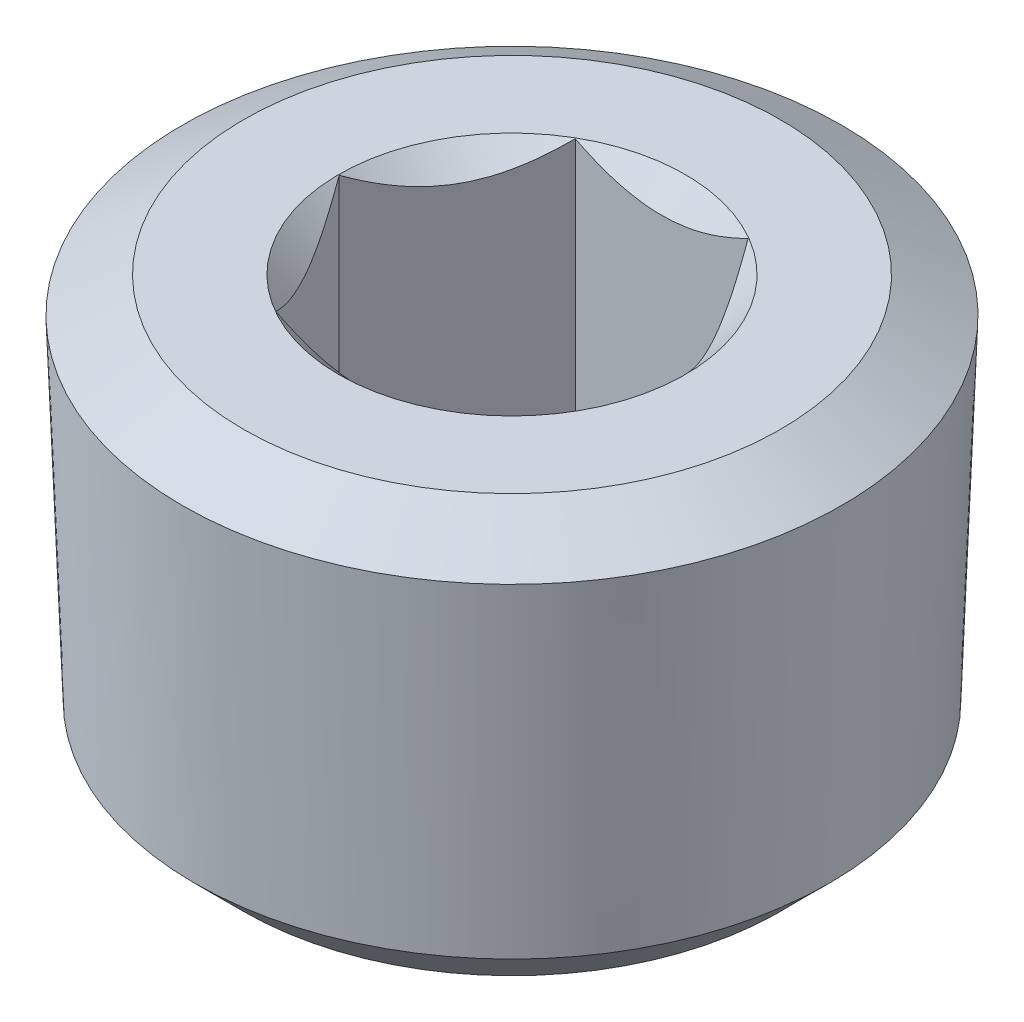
from build123d import *

# Parameters (mm, degrees)
CUT_EXTRUDE1_START = -8.89
CUT_EXTRUDE1_DEPTH = 8.874585


with BuildPart() as part:
    # Sketch2 → Revolve1 (revolve)
    with BuildSketch(Plane.XY, mode=Mode.PRIVATE) as revolve1_sk:
        Polygon((0, 0), (-8.653194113, 0), (-10.626463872, -1.139267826), (-10.234859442, -11.880334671), (-8.653194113, -13.462), (0, -13.462), align=None)
    revolve(revolve1_sk.sketch.rotate(Axis((0, 10.744282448, 0), (0, -1, 0)), 270), axis=Axis((0, 10.744282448, 0), (0, -1, 0)))

    # Sketch3 → Cut-Revolve1 (revolve, cut)
    with BuildSketch(Plane.XY, mode=Mode.PRIVATE) as cut_revolve1_sk:
        Polygon((0, 0), (-5.588, 0), (-4.826, -0.762), (-4.826, -8.89), (-2.712365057, -10.16), (0, -10.16), align=None)
    revolve(cut_revolve1_sk.sketch.rotate(Axis((0, 2.934222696, 0), (0, -1, 0)), 270), axis=Axis((0, 2.934222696, 0), (0, -1, 0)), mode=Mode.SUBTRACT)

    # Sketch4 → Cut-Extrude1 (cut)
    with BuildSketch(Plane(origin=(0, 0, 0), x_dir=(1, 0, 0), z_dir=(0, 1, 0)).offset(CUT_EXTRUDE1_START)):
        Polygon((-2.786292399, -4.826), (2.786292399, -4.826), (5.572584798, 0), (2.786292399, 4.826), (-2.786292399, 4.826), (-5.572584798, 0), align=None)
    extrude(amount=CUT_EXTRUDE1_DEPTH, mode=Mode.SUBTRACT)


solid = part.part
